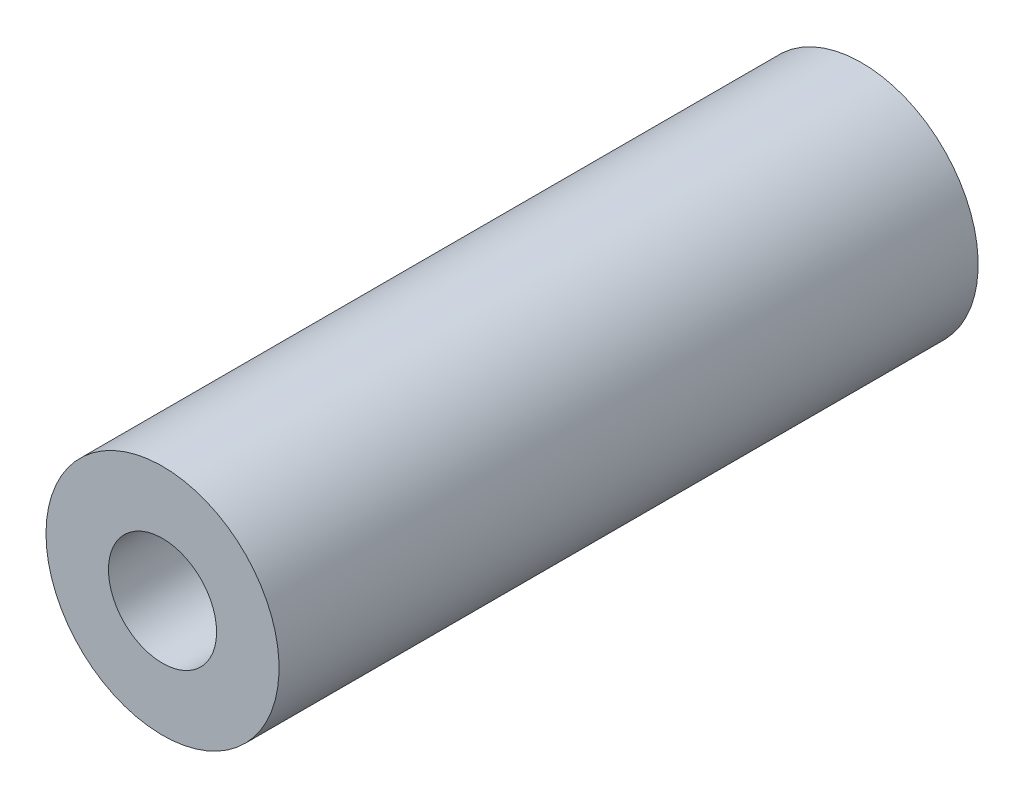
ISO-10303-21;
HEADER;
FILE_DESCRIPTION(('STEP AP214'),'2;1');
FILE_NAME('part.step','',(''),(''),'','','');
FILE_SCHEMA(('AUTOMOTIVE_DESIGN { 1 0 10303 214 1 1 1 1 }'));
ENDSEC;
DATA;
#1=APPLICATION_CONTEXT('core data for automotive mechanical design processes');
#2=APPLICATION_PROTOCOL_DEFINITION('international standard','automotive_design',2000,#1);
#3=PRODUCT_CONTEXT('',#1,'mechanical');
#4=PRODUCT('Part','Part','',(#3));
#5=PRODUCT_RELATED_PRODUCT_CATEGORY('part','',(#4));
#6=PRODUCT_DEFINITION_FORMATION('','',#4);
#7=PRODUCT_DEFINITION_CONTEXT('part definition',#1,'design');
#8=PRODUCT_DEFINITION('design','',#6,#7);
#9=PRODUCT_DEFINITION_SHAPE('','',#8);
#10=(LENGTH_UNIT() NAMED_UNIT(*) SI_UNIT(.MILLI.,.METRE.));
#11=(NAMED_UNIT(*) PLANE_ANGLE_UNIT() SI_UNIT($,.RADIAN.));
#12=(NAMED_UNIT(*) SI_UNIT($,.STERADIAN.) SOLID_ANGLE_UNIT());
#13=UNCERTAINTY_MEASURE_WITH_UNIT(LENGTH_MEASURE(1.E-05),#10,'distance_accuracy_value','');
#14=(GEOMETRIC_REPRESENTATION_CONTEXT(3) GLOBAL_UNCERTAINTY_ASSIGNED_CONTEXT((#13)) GLOBAL_UNIT_ASSIGNED_CONTEXT((#10,
#11,#12)) REPRESENTATION_CONTEXT('',''));
#15=CARTESIAN_POINT('',(0.,0.,0.));
#16=DIRECTION('',(0.,0.,1.));
#17=DIRECTION('',(1.,0.,0.));
#18=AXIS2_PLACEMENT_3D('',#15,#16,#17);
#19=CARTESIAN_POINT('',(0.,0.,19.05));
#20=DIRECTION('',(0.,0.,-1.));
#21=DIRECTION('',(-1.,0.,0.));
#22=AXIS2_PLACEMENT_3D('',#19,#20,#21);
#23=CYLINDRICAL_SURFACE('',#22,3.175);
#24=CARTESIAN_POINT('',(0.,0.,19.05));
#25=DIRECTION('',(0.,0.,1.));
#26=DIRECTION('',(1.,0.,0.));
#27=AXIS2_PLACEMENT_3D('',#24,#25,#26);
#28=CIRCLE('',#27,3.175);
#29=CARTESIAN_POINT('',(-3.175,0.,19.05));
#30=VERTEX_POINT('',#29);
#31=EDGE_CURVE('E10',#30,#30,#28,.T.);
#32=CARTESIAN_POINT('',(0.,0.,0.));
#33=DIRECTION('',(0.,0.,1.));
#34=DIRECTION('',(1.,0.,0.));
#35=AXIS2_PLACEMENT_3D('',#32,#33,#34);
#36=CIRCLE('',#35,3.175);
#37=CARTESIAN_POINT('',(-3.175,0.,0.));
#38=VERTEX_POINT('',#37);
#39=EDGE_CURVE('E33',#38,#38,#36,.T.);
#40=CARTESIAN_POINT('',(-3.175,0.,19.05));
#41=CARTESIAN_POINT('',(-3.175,0.,18.8515625));
#42=CARTESIAN_POINT('',(-3.175,0.,18.653125));
#43=CARTESIAN_POINT('',(-3.175,0.,18.25625));
#44=CARTESIAN_POINT('',(-3.175,0.,18.0578125));
#45=CARTESIAN_POINT('',(-3.175,0.,17.6609375));
#46=CARTESIAN_POINT('',(-3.175,0.,17.4625));
#47=CARTESIAN_POINT('',(-3.175,0.,17.065625));
#48=CARTESIAN_POINT('',(-3.175,0.,16.8671875));
#49=CARTESIAN_POINT('',(-3.175,0.,16.4703125));
#50=CARTESIAN_POINT('',(-3.175,0.,16.271875));
#51=CARTESIAN_POINT('',(-3.175,0.,15.875));
#52=CARTESIAN_POINT('',(-3.175,0.,15.6765625));
#53=CARTESIAN_POINT('',(-3.175,0.,15.2796875));
#54=CARTESIAN_POINT('',(-3.175,0.,15.08125));
#55=CARTESIAN_POINT('',(-3.175,0.,14.684375));
#56=CARTESIAN_POINT('',(-3.175,0.,14.4859375));
#57=CARTESIAN_POINT('',(-3.175,0.,14.0890625));
#58=CARTESIAN_POINT('',(-3.175,0.,13.890625));
#59=CARTESIAN_POINT('',(-3.175,0.,13.49375));
#60=CARTESIAN_POINT('',(-3.175,0.,13.2953125));
#61=CARTESIAN_POINT('',(-3.175,0.,12.8984375));
#62=CARTESIAN_POINT('',(-3.175,0.,12.7));
#63=CARTESIAN_POINT('',(-3.175,0.,12.303125));
#64=CARTESIAN_POINT('',(-3.175,0.,12.1046875));
#65=CARTESIAN_POINT('',(-3.175,0.,11.7078125));
#66=CARTESIAN_POINT('',(-3.175,0.,11.509375));
#67=CARTESIAN_POINT('',(-3.175,0.,11.1125));
#68=CARTESIAN_POINT('',(-3.175,0.,10.9140625));
#69=CARTESIAN_POINT('',(-3.175,0.,10.5171875));
#70=CARTESIAN_POINT('',(-3.175,0.,10.31875));
#71=CARTESIAN_POINT('',(-3.175,0.,9.921875));
#72=CARTESIAN_POINT('',(-3.175,0.,9.7234375));
#73=CARTESIAN_POINT('',(-3.175,0.,9.3265625));
#74=CARTESIAN_POINT('',(-3.175,0.,9.128125));
#75=CARTESIAN_POINT('',(-3.175,0.,8.73125));
#76=CARTESIAN_POINT('',(-3.175,0.,8.5328125));
#77=CARTESIAN_POINT('',(-3.175,0.,8.1359375));
#78=CARTESIAN_POINT('',(-3.175,0.,7.9375));
#79=CARTESIAN_POINT('',(-3.175,0.,7.540625));
#80=CARTESIAN_POINT('',(-3.175,0.,7.3421875));
#81=CARTESIAN_POINT('',(-3.175,0.,6.9453125));
#82=CARTESIAN_POINT('',(-3.175,0.,6.746875));
#83=CARTESIAN_POINT('',(-3.175,0.,6.35));
#84=CARTESIAN_POINT('',(-3.175,0.,6.1515625));
#85=CARTESIAN_POINT('',(-3.175,0.,5.7546875));
#86=CARTESIAN_POINT('',(-3.175,0.,5.55625));
#87=CARTESIAN_POINT('',(-3.175,0.,5.159375));
#88=CARTESIAN_POINT('',(-3.175,0.,4.9609375));
#89=CARTESIAN_POINT('',(-3.175,0.,4.5640625));
#90=CARTESIAN_POINT('',(-3.175,0.,4.365625));
#91=CARTESIAN_POINT('',(-3.175,0.,3.96875));
#92=CARTESIAN_POINT('',(-3.175,0.,3.7703125));
#93=CARTESIAN_POINT('',(-3.175,0.,3.3734375));
#94=CARTESIAN_POINT('',(-3.175,0.,3.175));
#95=CARTESIAN_POINT('',(-3.175,0.,2.778125));
#96=CARTESIAN_POINT('',(-3.175,0.,2.5796875));
#97=CARTESIAN_POINT('',(-3.175,0.,2.1828125));
#98=CARTESIAN_POINT('',(-3.175,0.,1.984375));
#99=CARTESIAN_POINT('',(-3.175,0.,1.5875));
#100=CARTESIAN_POINT('',(-3.175,0.,1.3890625));
#101=CARTESIAN_POINT('',(-3.175,0.,0.992187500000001));
#102=CARTESIAN_POINT('',(-3.175,0.,0.793750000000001));
#103=CARTESIAN_POINT('',(-3.175,0.,0.396875));
#104=CARTESIAN_POINT('',(-3.175,0.,0.1984375));
#105=CARTESIAN_POINT('',(-3.175,0.,0.));
#106=B_SPLINE_CURVE_WITH_KNOTS('',3,(#40,#41,#42,#43,#44,#45,#46,#47,#48,#49,#50,#51,#52,#53,
#54,#55,#56,#57,#58,#59,#60,#61,#62,#63,#64,#65,#66,#67,#68,#69,#70,#71,#72,#73,#74,#75,#76,#77,
#78,#79,#80,#81,#82,#83,#84,#85,#86,#87,#88,#89,#90,#91,#92,#93,#94,#95,#96,#97,#98,#99,#100,
#101,#102,#103,#104,#105),.UNSPECIFIED.,.F.,.F.,(4,2,2,2,2,2,2,2,2,2,2,2,2,2,2,2,2,2,2,2,2,2,2,
2,2,2,2,2,2,2,2,2,4),(0.,0.595312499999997,1.190625,1.7859375,2.38125,2.9765625,3.571875,
4.1671875,4.7625,5.3578125,5.953125,6.5484375,7.14375,7.7390625,8.334375,8.9296875,9.525,
10.1203125,10.715625,11.3109375,11.90625,12.5015625,13.096875,13.6921875,14.2875,14.8828125,
15.478125,16.0734375,16.66875,17.2640625,17.859375,18.4546875,19.05),.UNSPECIFIED.);
#107=EDGE_CURVE('BSEAM30',#30,#38,#106,.T.);
#108=ORIENTED_EDGE('',*,*,#31,.F.);
#109=ORIENTED_EDGE('',*,*,#39,.T.);
#110=ORIENTED_EDGE('',*,*,#107,.T.);
#111=ORIENTED_EDGE('',*,*,#107,.F.);
#112=EDGE_LOOP('',(#108,#110,#109,#111));
#113=FACE_BOUND('',#112,.T.);
#114=ADVANCED_FACE('F30',(#113),#23,.T.);
#115=CARTESIAN_POINT('',(0.,0.,19.05));
#116=DIRECTION('',(0.,0.,1.));
#117=DIRECTION('',(1.,0.,0.));
#118=AXIS2_PLACEMENT_3D('',#115,#116,#117);
#119=PLANE('',#118);
#120=CARTESIAN_POINT('',(0.,0.,19.05));
#121=DIRECTION('',(0.,0.,1.));
#122=DIRECTION('',(1.,0.,0.));
#123=AXIS2_PLACEMENT_3D('',#120,#121,#122);
#124=CIRCLE('',#123,1.47319999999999);
#125=CARTESIAN_POINT('',(1.47319999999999,0.,19.05));
#126=VERTEX_POINT('',#125);
#127=EDGE_CURVE('E44',#126,#126,#124,.T.);
#128=ORIENTED_EDGE('',*,*,#127,.F.);
#129=EDGE_LOOP('',(#128));
#130=FACE_BOUND('',#129,.T.);
#131=ORIENTED_EDGE('',*,*,#31,.T.);
#132=EDGE_LOOP('',(#131));
#133=FACE_BOUND('',#132,.T.);
#134=ADVANCED_FACE('F50',(#130,#133),#119,.T.);
#135=CARTESIAN_POINT('',(0.,0.,0.));
#136=DIRECTION('',(0.,0.,1.));
#137=DIRECTION('',(1.,0.,0.));
#138=AXIS2_PLACEMENT_3D('',#135,#136,#137);
#139=PLANE('',#138);
#140=CARTESIAN_POINT('',(0.,0.,0.));
#141=DIRECTION('',(0.,0.,1.));
#142=DIRECTION('',(1.,0.,0.));
#143=AXIS2_PLACEMENT_3D('',#140,#141,#142);
#144=CIRCLE('',#143,1.47319999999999);
#145=CARTESIAN_POINT('',(1.47319999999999,0.,0.));
#146=VERTEX_POINT('',#145);
#147=EDGE_CURVE('E40',#146,#146,#144,.T.);
#148=ORIENTED_EDGE('',*,*,#147,.T.);
#149=EDGE_LOOP('',(#148));
#150=FACE_BOUND('',#149,.T.);
#151=ORIENTED_EDGE('',*,*,#39,.F.);
#152=EDGE_LOOP('',(#151));
#153=FACE_BOUND('',#152,.T.);
#154=ADVANCED_FACE('F52',(#150,#153),#139,.F.);
#155=CARTESIAN_POINT('',(0.,0.,19.05));
#156=DIRECTION('',(0.,0.,1.));
#157=DIRECTION('',(1.,0.,0.));
#158=AXIS2_PLACEMENT_3D('',#155,#156,#157);
#159=CYLINDRICAL_SURFACE('',#158,1.47319999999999);
#160=ORIENTED_EDGE('',*,*,#147,.F.);
#161=EDGE_LOOP('',(#160));
#162=FACE_BOUND('',#161,.T.);
#163=ORIENTED_EDGE('',*,*,#127,.T.);
#164=EDGE_LOOP('',(#163));
#165=FACE_BOUND('',#164,.T.);
#166=ADVANCED_FACE('F48',(#162,#165),#159,.F.);
#167=CLOSED_SHELL('',(#114,#134,#154,#166));
#168=MANIFOLD_SOLID_BREP('B2',#167);
#169=ADVANCED_BREP_SHAPE_REPRESENTATION('',(#18,#168),#14);
#170=SHAPE_DEFINITION_REPRESENTATION(#9,#169);
ENDSEC;
END-ISO-10303-21;
